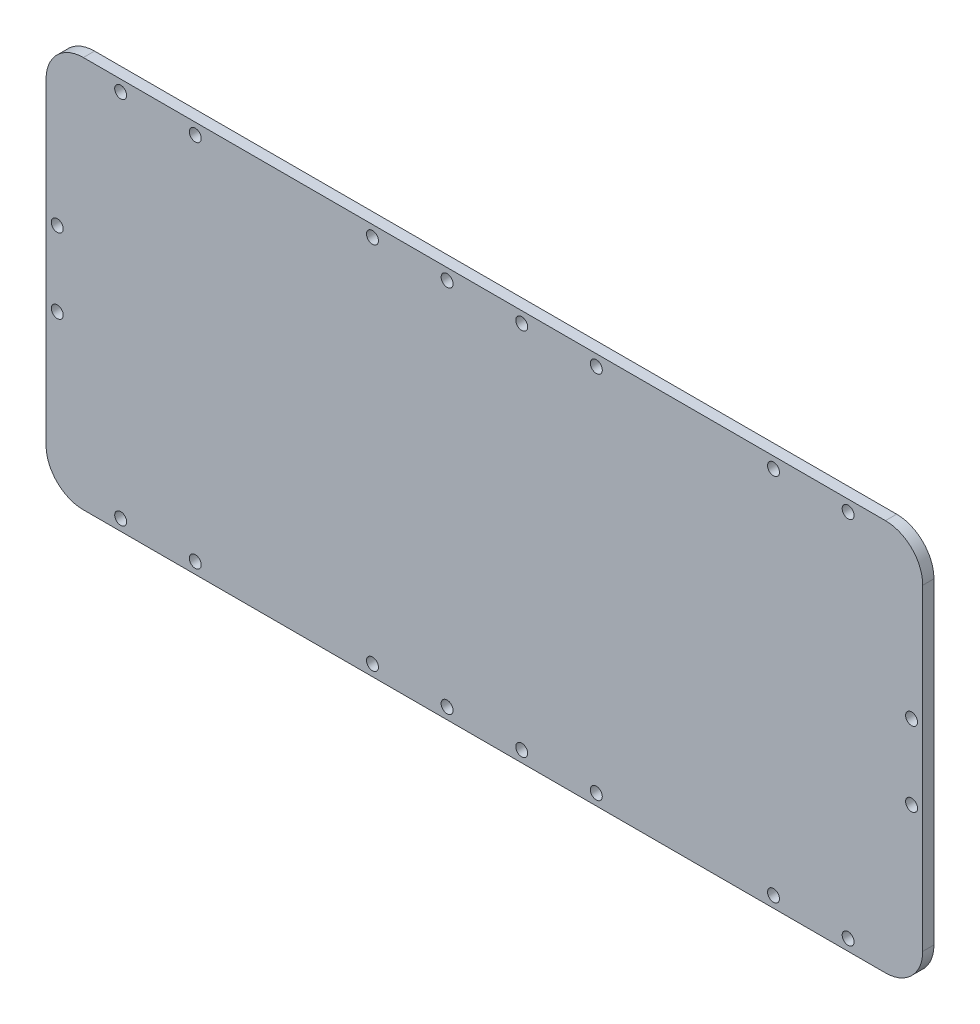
from build123d import *

# Parameters (mm, degrees)
SKETCH_1_W          = 269
SKETCH_1_H          = 105
EXTRUDE_1_DEPTH     = 3
SKETCH_2_R          = 1.6
CUT_EXTRUDE_1_DEPTH = 3
SKETCH_4_W          = 17
SKETCH_4_H          = 105
CUT_EXTRUDE_2_DEPTH = 5
SKETCH_6_R          = 1.6
CUT_EXTRUDE_3_DEPTH = 10
FILLET_1_R          = 10


with BuildPart() as part:
    # Sketch 1 → Extrude 1 (new body)
    with BuildSketch(Plane.XY):
        with Locations((134.5, 52.5)):
            Rectangle(SKETCH_1_W, SKETCH_1_H)
    extrude(amount=EXTRUDE_1_DEPTH)

    # Sketch 2 → Cut-Extrude 1 (cut)
    with BuildSketch(Plane.XY.offset(3)):
        with Locations((37, 3)):
            Circle(SKETCH_2_R)
        with Locations((57, 3)):
            Circle(SKETCH_2_R)
        with Locations((104.5, 3)):
            Circle(SKETCH_2_R)
        with Locations((124.5, 3)):
            Circle(SKETCH_2_R)
        with Locations(Location((144.5, 3, 0), (0, 0, 180))):
            Circle(SKETCH_2_R)
        with Locations(Location((164.5, 3, 0), (0, 0, 180))):
            Circle(SKETCH_2_R)
        with Locations(Location((212, 3, 0), (0, 0, 180))):
            Circle(SKETCH_2_R)
        with Locations(Location((232, 3, 0), (0, 0, 180))):
            Circle(SKETCH_2_R)
        with Locations((232, 102)):
            Circle(SKETCH_2_R)
        with Locations((212, 102)):
            Circle(SKETCH_2_R)
        with Locations((164.5, 102)):
            Circle(SKETCH_2_R)
        with Locations((144.5, 102)):
            Circle(SKETCH_2_R)
        with Locations(Location((124.5, 102, 0), (0, 0, 180))):
            Circle(SKETCH_2_R)
        with Locations(Location((104.5, 102, 0), (0, 0, 180))):
            Circle(SKETCH_2_R)
        with Locations(Location((57, 102, 0), (0, 0, 180))):
            Circle(SKETCH_2_R)
        with Locations(Location((37, 102, 0), (0, 0, 180))):
            Circle(SKETCH_2_R)
    extrude(amount=-CUT_EXTRUDE_1_DEPTH, mode=Mode.SUBTRACT)

    # Sketch 4 → Cut-Extrude 2 (cut)
    with BuildSketch(Plane.XY.offset(3)):
        with Locations((8.5, 52.5)):
            Rectangle(SKETCH_4_W, SKETCH_4_H)
        with Locations((260.5, 52.5)):
            Rectangle(SKETCH_4_W, SKETCH_4_H)
    extrude(amount=-CUT_EXTRUDE_2_DEPTH, mode=Mode.SUBTRACT)

    # Sketch 6 → Cut-Extrude 3 (cut)
    with BuildSketch(Plane.XY.offset(3)):
        with Locations((20, 62.5)):
            Circle(SKETCH_6_R)
        with Locations((20, 42.5)):
            Circle(SKETCH_6_R)
        with Locations(Location((249, 42.5, 0), (0, 0, 180))):
            Circle(SKETCH_6_R)
        with Locations(Location((249, 62.5, 0), (0, 0, 180))):
            Circle(SKETCH_6_R)
    extrude(amount=-CUT_EXTRUDE_3_DEPTH, mode=Mode.SUBTRACT)

    # Fillet 1
    fillet_1_edges = [part.edges().sort_by_distance(p)[0] for p in [
        (17, 105, 1.5),
        (17, 0, 1.5),
        (252, 0, 1.5),
        (252, 105, 1.5),
    ]]
    fillet(fillet_1_edges, radius=FILLET_1_R)


solid = part.part
